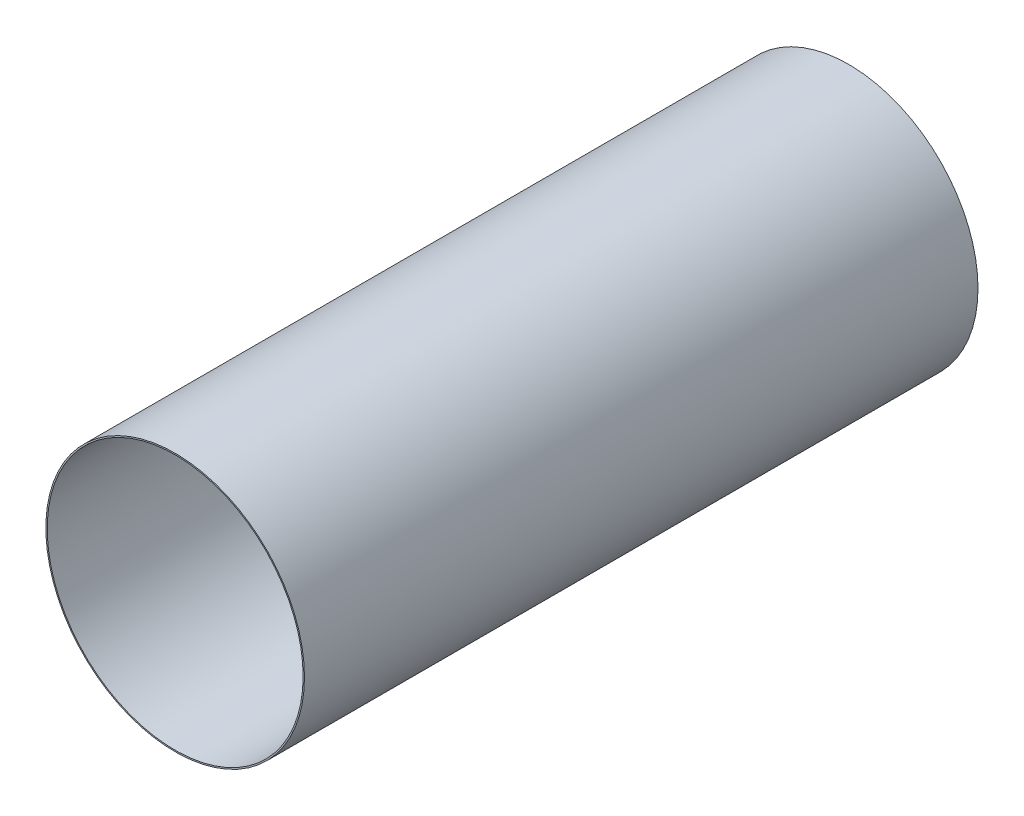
from build123d import *

# Parameters (mm, degrees)
SKETCH1_R           = 19.2
SKETCH1_R_2         = 19
BOSS_EXTRUDE1_DEPTH = 100


with BuildPart() as part:
    # Sketch1 → Boss-Extrude1 (new body)
    with BuildSketch(Plane.XY):
        Circle(SKETCH1_R)
        Circle(SKETCH1_R_2, mode=Mode.SUBTRACT)
    extrude(amount=-BOSS_EXTRUDE1_DEPTH)


solid = part.part
